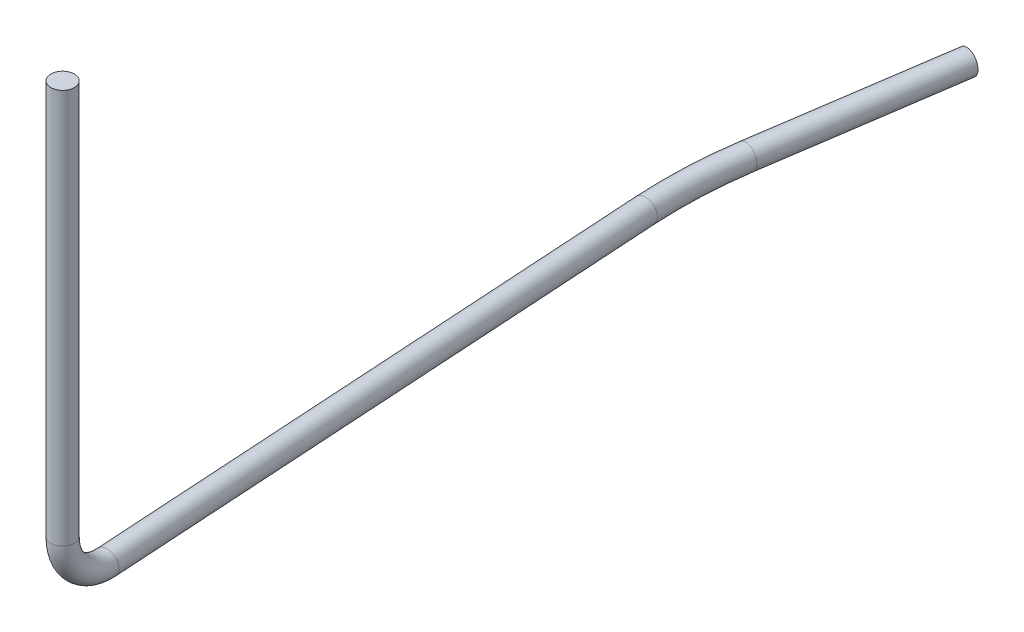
ISO-10303-21;
HEADER;
FILE_DESCRIPTION(('STEP AP214'),'2;1');
FILE_NAME('part.step','',(''),(''),'','','');
FILE_SCHEMA(('AUTOMOTIVE_DESIGN { 1 0 10303 214 1 1 1 1 }'));
ENDSEC;
DATA;
#1=APPLICATION_CONTEXT('core data for automotive mechanical design processes');
#2=APPLICATION_PROTOCOL_DEFINITION('international standard','automotive_design',2000,#1);
#3=PRODUCT_CONTEXT('',#1,'mechanical');
#4=PRODUCT('Part','Part','',(#3));
#5=PRODUCT_RELATED_PRODUCT_CATEGORY('part','',(#4));
#6=PRODUCT_DEFINITION_FORMATION('','',#4);
#7=PRODUCT_DEFINITION_CONTEXT('part definition',#1,'design');
#8=PRODUCT_DEFINITION('design','',#6,#7);
#9=PRODUCT_DEFINITION_SHAPE('','',#8);
#10=(LENGTH_UNIT() NAMED_UNIT(*) SI_UNIT(.MILLI.,.METRE.));
#11=(NAMED_UNIT(*) PLANE_ANGLE_UNIT() SI_UNIT($,.RADIAN.));
#12=(NAMED_UNIT(*) SI_UNIT($,.STERADIAN.) SOLID_ANGLE_UNIT());
#13=UNCERTAINTY_MEASURE_WITH_UNIT(LENGTH_MEASURE(1.E-05),#10,'distance_accuracy_value','');
#14=(GEOMETRIC_REPRESENTATION_CONTEXT(3) GLOBAL_UNCERTAINTY_ASSIGNED_CONTEXT((#13)) GLOBAL_UNIT_ASSIGNED_CONTEXT((#10,
#11,#12)) REPRESENTATION_CONTEXT('',''));
#15=CARTESIAN_POINT('',(0.,0.,0.));
#16=DIRECTION('',(0.,0.,1.));
#17=DIRECTION('',(1.,0.,0.));
#18=AXIS2_PLACEMENT_3D('',#15,#16,#17);
#19=CARTESIAN_POINT('',(4.20311164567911,-3.39999999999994,-6.79982274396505));
#20=DIRECTION('',(0.146700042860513,0.,-0.98918102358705));
#21=DIRECTION('',(-0.98918102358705,0.,-0.146700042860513));
#22=AXIS2_PLACEMENT_3D('',#19,#20,#21);
#23=CYLINDRICAL_SURFACE('',#22,0.25);
#24=CARTESIAN_POINT('',(4.20311164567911,-3.39999999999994,-6.79982274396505));
#25=DIRECTION('',(0.146700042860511,0.,-0.98918102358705));
#26=DIRECTION('',(0.0608212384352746,0.99810791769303,0.00902006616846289));
#27=AXIS2_PLACEMENT_3D('',#24,#25,#26);
#28=CIRCLE('',#27,0.25);
#29=CARTESIAN_POINT('',(3.95581638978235,-3.39999999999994,-6.83649775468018));
#30=VERTEX_POINT('',#29);
#31=EDGE_CURVE('E30',#30,#30,#28,.T.);
#32=ORIENTED_EDGE('',*,*,#31,.T.);
#33=EDGE_LOOP('',(#32));
#34=FACE_BOUND('',#33,.T.);
#35=CARTESIAN_POINT('',(4.81078286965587,-3.39999999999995,-10.8972778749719));
#36=DIRECTION('',(0.146700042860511,0.,-0.98918102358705));
#37=DIRECTION('',(0.0608212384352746,0.99810791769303,0.00902006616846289));
#38=AXIS2_PLACEMENT_3D('',#35,#36,#37);
#39=CIRCLE('',#38,0.25);
#40=CARTESIAN_POINT('',(4.82598817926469,-3.15047302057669,-10.8950228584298));
#41=VERTEX_POINT('',#40);
#42=EDGE_CURVE('E10',#41,#41,#39,.T.);
#43=ORIENTED_EDGE('',*,*,#42,.F.);
#44=EDGE_LOOP('',(#43));
#45=FACE_BOUND('',#44,.T.);
#46=ADVANCED_FACE('F24',(#34,#45),#23,.T.);
#47=CARTESIAN_POINT('',(14.0949218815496,-3.39999999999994,-5.33282231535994));
#48=DIRECTION('',(0.,-1.,0.));
#49=DIRECTION('',(0.,0.,-1.));
#50=AXIS2_PLACEMENT_3D('',#47,#48,#49);
#51=TOROIDAL_SURFACE('',#50,10.,0.25);
#52=CARTESIAN_POINT('',(4.11384270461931,-3.39999999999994,-4.71795772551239));
#53=DIRECTION('',(-0.0614864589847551,0.,-0.99810791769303));
#54=DIRECTION('',(0.0613701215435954,0.99810791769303,-0.00378058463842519));
#55=AXIS2_PLACEMENT_3D('',#52,#53,#54);
#56=CIRCLE('',#55,0.25);
#57=CARTESIAN_POINT('',(3.86431572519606,-3.39999999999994,-4.7025861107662));
#58=VERTEX_POINT('',#57);
#59=EDGE_CURVE('E34',#58,#58,#56,.T.);
#60=CARTESIAN_POINT('',(14.0949218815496,-3.39999999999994,-5.33282231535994));
#61=DIRECTION('',(0.,-1.,0.));
#62=DIRECTION('',(0.,0.,-1.));
#63=AXIS2_PLACEMENT_3D('',#60,#61,#62);
#64=CIRCLE('',#63,10.25);
#65=EDGE_CURVE('',#58,#30,#64,.T.);
#66=ORIENTED_EDGE('',*,*,#59,.T.);
#67=ORIENTED_EDGE('',*,*,#31,.F.);
#68=ORIENTED_EDGE('',*,*,#65,.T.);
#69=ORIENTED_EDGE('',*,*,#65,.F.);
#70=EDGE_LOOP('',(#66,#68,#67,#69));
#71=FACE_BOUND('',#70,.T.);
#72=ADVANCED_FACE('F61',(#71),#51,.T.);
#73=CARTESIAN_POINT('',(4.86587256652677,-3.39999999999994,7.48972136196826));
#74=DIRECTION('',(-0.0614864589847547,0.,-0.99810791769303));
#75=DIRECTION('',(-0.99810791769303,0.,0.0614864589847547));
#76=AXIS2_PLACEMENT_3D('',#73,#74,#75);
#77=CYLINDRICAL_SURFACE('',#76,0.25);
#78=CARTESIAN_POINT('',(4.86587256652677,-3.39999999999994,7.48972136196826));
#79=DIRECTION('',(-0.0614864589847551,0.,-0.99810791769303));
#80=DIRECTION('',(0.0613701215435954,0.99810791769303,-0.00378058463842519));
#81=AXIS2_PLACEMENT_3D('',#78,#79,#80);
#82=CIRCLE('',#81,0.25);
#83=CARTESIAN_POINT('',(4.86587256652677,-3.64999999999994,7.48972136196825));
#84=VERTEX_POINT('',#83);
#85=EDGE_CURVE('E38',#84,#84,#82,.T.);
#86=ORIENTED_EDGE('',*,*,#85,.T.);
#87=EDGE_LOOP('',(#86));
#88=FACE_BOUND('',#87,.T.);
#89=ORIENTED_EDGE('',*,*,#59,.F.);
#90=EDGE_LOOP('',(#89));
#91=FACE_BOUND('',#90,.T.);
#92=ADVANCED_FACE('F65',(#88,#91),#77,.T.);
#93=CARTESIAN_POINT('',(4.86587256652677,-2.39999999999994,7.48972136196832));
#94=DIRECTION('',(0.99810791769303,0.,-0.0614864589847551));
#95=DIRECTION('',(-0.0614864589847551,0.,-0.99810791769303));
#96=AXIS2_PLACEMENT_3D('',#93,#94,#95);
#97=TOROIDAL_SURFACE('',#96,1.,0.25);
#98=CARTESIAN_POINT('',(4.92735902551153,-2.39999999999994,8.48782927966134));
#99=DIRECTION('',(0.,-1.,0.));
#100=DIRECTION('',(0.,0.,-1.));
#101=AXIS2_PLACEMENT_3D('',#98,#99,#100);
#102=CIRCLE('',#101,0.25);
#103=CARTESIAN_POINT('',(4.94273064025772,-2.39999999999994,8.7373562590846));
#104=VERTEX_POINT('',#103);
#105=EDGE_CURVE('E43',#104,#104,#102,.T.);
#106=CARTESIAN_POINT('',(4.86587256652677,-2.39999999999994,7.48972136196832));
#107=DIRECTION('',(0.99810791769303,0.,-0.0614864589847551));
#108=DIRECTION('',(-0.0614864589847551,0.,-0.99810791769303));
#109=AXIS2_PLACEMENT_3D('',#106,#107,#108);
#110=CIRCLE('',#109,1.25);
#111=EDGE_CURVE('',#104,#84,#110,.T.);
#112=ORIENTED_EDGE('',*,*,#105,.T.);
#113=ORIENTED_EDGE('',*,*,#85,.F.);
#114=ORIENTED_EDGE('',*,*,#111,.T.);
#115=ORIENTED_EDGE('',*,*,#111,.F.);
#116=EDGE_LOOP('',(#112,#114,#113,#115));
#117=FACE_BOUND('',#116,.T.);
#118=ADVANCED_FACE('F71',(#117),#97,.T.);
#119=CARTESIAN_POINT('',(4.92735902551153,-2.39999999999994,8.48782927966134));
#120=DIRECTION('',(0.,1.,0.));
#121=DIRECTION('',(0.,0.,1.));
#122=AXIS2_PLACEMENT_3D('',#119,#120,#121);
#123=CYLINDRICAL_SURFACE('',#122,0.25);
#124=ORIENTED_EDGE('',*,*,#105,.F.);
#125=EDGE_LOOP('',(#124));
#126=FACE_BOUND('',#125,.T.);
#127=CARTESIAN_POINT('',(4.92735902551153,6.,8.48782927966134));
#128=DIRECTION('',(0.,-1.,0.));
#129=DIRECTION('',(0.,0.,-1.));
#130=AXIS2_PLACEMENT_3D('',#127,#128,#129);
#131=CIRCLE('',#130,0.25);
#132=CARTESIAN_POINT('',(4.92735902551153,6.,8.23782927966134));
#133=VERTEX_POINT('',#132);
#134=EDGE_CURVE('E46',#133,#133,#131,.T.);
#135=ORIENTED_EDGE('',*,*,#134,.T.);
#136=EDGE_LOOP('',(#135));
#137=FACE_BOUND('',#136,.T.);
#138=ADVANCED_FACE('F50',(#126,#137),#123,.T.);
#139=CARTESIAN_POINT('',(4.81078286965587,-3.39999999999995,-10.8972778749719));
#140=DIRECTION('',(0.146700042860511,0.,-0.98918102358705));
#141=DIRECTION('',(0.0608212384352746,0.99810791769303,0.00902006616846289));
#142=AXIS2_PLACEMENT_3D('',#139,#140,#141);
#143=PLANE('',#142);
#144=ORIENTED_EDGE('',*,*,#42,.T.);
#145=EDGE_LOOP('',(#144));
#146=FACE_BOUND('',#145,.T.);
#147=ADVANCED_FACE('F54',(#146),#143,.T.);
#148=CARTESIAN_POINT('',(4.92735902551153,6.,8.48782927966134));
#149=DIRECTION('',(0.,-1.,0.));
#150=DIRECTION('',(0.,0.,-1.));
#151=AXIS2_PLACEMENT_3D('',#148,#149,#150);
#152=PLANE('',#151);
#153=ORIENTED_EDGE('',*,*,#134,.F.);
#154=EDGE_LOOP('',(#153));
#155=FACE_BOUND('',#154,.T.);
#156=ADVANCED_FACE('F52',(#155),#152,.F.);
#157=CLOSED_SHELL('',(#46,#72,#92,#118,#138,#147,#156));
#158=MANIFOLD_SOLID_BREP('B2',#157);
#159=ADVANCED_BREP_SHAPE_REPRESENTATION('',(#18,#158),#14);
#160=SHAPE_DEFINITION_REPRESENTATION(#9,#159);
ENDSEC;
END-ISO-10303-21;
